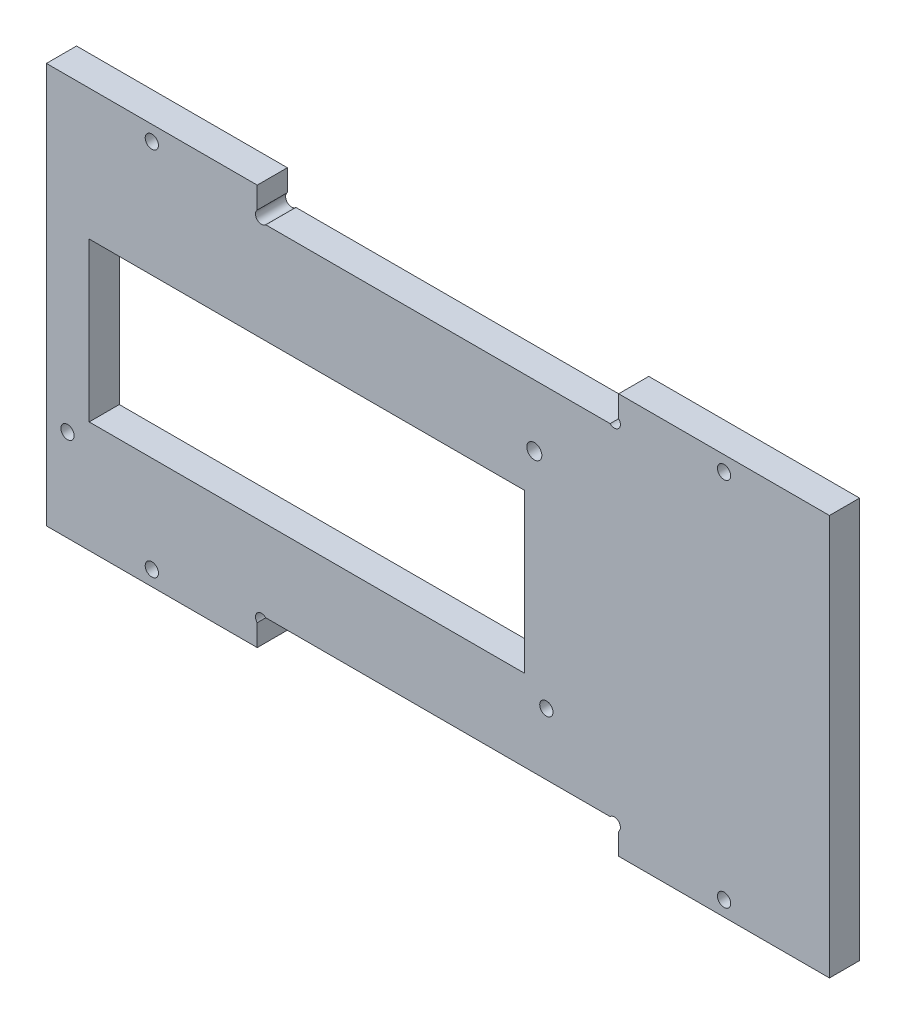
ISO-10303-21;
HEADER;
FILE_DESCRIPTION(('STEP AP214'),'2;1');
FILE_NAME('part.step','',(''),(''),'','','');
FILE_SCHEMA(('AUTOMOTIVE_DESIGN { 1 0 10303 214 1 1 1 1 }'));
ENDSEC;
DATA;
#1=APPLICATION_CONTEXT('core data for automotive mechanical design processes');
#2=APPLICATION_PROTOCOL_DEFINITION('international standard','automotive_design',2000,#1);
#3=PRODUCT_CONTEXT('',#1,'mechanical');
#4=PRODUCT('Part','Part','',(#3));
#5=PRODUCT_RELATED_PRODUCT_CATEGORY('part','',(#4));
#6=PRODUCT_DEFINITION_FORMATION('','',#4);
#7=PRODUCT_DEFINITION_CONTEXT('part definition',#1,'design');
#8=PRODUCT_DEFINITION('design','',#6,#7);
#9=PRODUCT_DEFINITION_SHAPE('','',#8);
#10=(LENGTH_UNIT() NAMED_UNIT(*) SI_UNIT(.MILLI.,.METRE.));
#11=(NAMED_UNIT(*) PLANE_ANGLE_UNIT() SI_UNIT($,.RADIAN.));
#12=(NAMED_UNIT(*) SI_UNIT($,.STERADIAN.) SOLID_ANGLE_UNIT());
#13=UNCERTAINTY_MEASURE_WITH_UNIT(LENGTH_MEASURE(1.E-05),#10,'distance_accuracy_value','');
#14=(GEOMETRIC_REPRESENTATION_CONTEXT(3) GLOBAL_UNCERTAINTY_ASSIGNED_CONTEXT((#13)) GLOBAL_UNIT_ASSIGNED_CONTEXT((#10,
#11,#12)) REPRESENTATION_CONTEXT('',''));
#15=CARTESIAN_POINT('',(0.,0.,0.));
#16=DIRECTION('',(0.,0.,1.));
#17=DIRECTION('',(1.,0.,0.));
#18=AXIS2_PLACEMENT_3D('',#15,#16,#17);
#19=CARTESIAN_POINT('',(0.,66.5,5.));
#20=DIRECTION('',(0.,0.,-1.));
#21=DIRECTION('',(-1.,0.,0.));
#22=AXIS2_PLACEMENT_3D('',#19,#20,#21);
#23=PLANE('',#22);
#24=CARTESIAN_POINT('',(112.5,2.5,5.));
#25=DIRECTION('',(0.,0.,-1.));
#26=DIRECTION('',(-1.,0.,0.));
#27=AXIS2_PLACEMENT_3D('',#24,#25,#26);
#28=CIRCLE('',#27,1.1);
#29=CARTESIAN_POINT('',(111.4,2.5,5.));
#30=VERTEX_POINT('',#29);
#31=EDGE_CURVE('E246',#30,#30,#28,.T.);
#32=ORIENTED_EDGE('',*,*,#31,.T.);
#33=EDGE_LOOP('',(#32));
#34=FACE_BOUND('',#33,.T.);
#35=CARTESIAN_POINT('',(17.5,2.5,5.));
#36=DIRECTION('',(0.,0.,1.));
#37=DIRECTION('',(1.,0.,0.));
#38=AXIS2_PLACEMENT_3D('',#35,#36,#37);
#39=CIRCLE('',#38,1.1);
#40=CARTESIAN_POINT('',(18.6,2.5,5.));
#41=VERTEX_POINT('',#40);
#42=EDGE_CURVE('E255',#41,#41,#39,.T.);
#43=ORIENTED_EDGE('',*,*,#42,.F.);
#44=EDGE_LOOP('',(#43));
#45=FACE_BOUND('',#44,.T.);
#46=DIRECTION('',(-1.,0.,0.));
#47=VECTOR('',#46,1.);
#48=CARTESIAN_POINT('',(79.4,44.8,5.));
#49=LINE('',#48,#47);
#50=CARTESIAN_POINT('',(79.4,44.8,5.));
#51=VERTEX_POINT('',#50);
#52=CARTESIAN_POINT('',(7.09999999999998,44.8,5.));
#53=VERTEX_POINT('',#52);
#54=EDGE_CURVE('E348',#51,#53,#49,.T.);
#55=ORIENTED_EDGE('',*,*,#54,.F.);
#56=DIRECTION('',(0.,1.,0.));
#57=VECTOR('',#56,1.);
#58=CARTESIAN_POINT('',(79.4,18.5,5.));
#59=LINE('',#58,#57);
#60=CARTESIAN_POINT('',(79.4,18.5,5.));
#61=VERTEX_POINT('',#60);
#62=EDGE_CURVE('E346',#61,#51,#59,.T.);
#63=ORIENTED_EDGE('',*,*,#62,.F.);
#64=DIRECTION('',(1.,0.,0.));
#65=VECTOR('',#64,1.);
#66=CARTESIAN_POINT('',(79.4,18.5,5.));
#67=LINE('',#66,#65);
#68=CARTESIAN_POINT('',(7.09999999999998,18.5,5.));
#69=VERTEX_POINT('',#68);
#70=EDGE_CURVE('E354',#69,#61,#67,.T.);
#71=ORIENTED_EDGE('',*,*,#70,.F.);
#72=DIRECTION('',(0.,-1.,0.));
#73=VECTOR('',#72,1.);
#74=CARTESIAN_POINT('',(7.09999999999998,18.5,5.));
#75=LINE('',#74,#73);
#76=EDGE_CURVE('E351',#53,#69,#75,.T.);
#77=ORIENTED_EDGE('',*,*,#76,.F.);
#78=EDGE_LOOP('',(#55,#63,#71,#77));
#79=FACE_BOUND('',#78,.T.);
#80=CARTESIAN_POINT('',(3.5,15.25,5.));
#81=DIRECTION('',(0.,0.,1.));
#82=DIRECTION('',(1.,0.,0.));
#83=AXIS2_PLACEMENT_3D('',#80,#81,#82);
#84=CIRCLE('',#83,1.1);
#85=CARTESIAN_POINT('',(4.6,15.25,5.));
#86=VERTEX_POINT('',#85);
#87=EDGE_CURVE('E370',#86,#86,#84,.T.);
#88=ORIENTED_EDGE('',*,*,#87,.F.);
#89=EDGE_LOOP('',(#88));
#90=FACE_BOUND('',#89,.T.);
#91=CARTESIAN_POINT('',(83.,15.25,5.));
#92=DIRECTION('',(0.,0.,1.));
#93=DIRECTION('',(1.,0.,0.));
#94=AXIS2_PLACEMENT_3D('',#91,#92,#93);
#95=CIRCLE('',#94,1.10000000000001);
#96=CARTESIAN_POINT('',(84.1,15.25,5.));
#97=VERTEX_POINT('',#96);
#98=EDGE_CURVE('E376',#97,#97,#95,.T.);
#99=ORIENTED_EDGE('',*,*,#98,.F.);
#100=EDGE_LOOP('',(#99));
#101=FACE_BOUND('',#100,.T.);
#102=CARTESIAN_POINT('',(81.,51.25,5.));
#103=DIRECTION('',(0.,0.,1.));
#104=DIRECTION('',(1.,0.,0.));
#105=AXIS2_PLACEMENT_3D('',#102,#103,#104);
#106=CIRCLE('',#105,1.25);
#107=CARTESIAN_POINT('',(82.25,51.25,5.));
#108=VERTEX_POINT('',#107);
#109=EDGE_CURVE('E382',#108,#108,#106,.T.);
#110=ORIENTED_EDGE('',*,*,#109,.F.);
#111=EDGE_LOOP('',(#110));
#112=FACE_BOUND('',#111,.T.);
#113=DIRECTION('',(0.,1.,0.));
#114=VECTOR('',#113,1.);
#115=CARTESIAN_POINT('',(95.,66.5,5.));
#116=LINE('',#115,#114);
#117=CARTESIAN_POINT('',(95.,62.9142135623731,5.));
#118=VERTEX_POINT('',#117);
#119=CARTESIAN_POINT('',(95.,66.5,5.));
#120=VERTEX_POINT('',#119);
#121=EDGE_CURVE('E304',#118,#120,#116,.T.);
#122=ORIENTED_EDGE('',*,*,#121,.F.);
#123=CARTESIAN_POINT('',(94.2928932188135,62.2071067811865,5.));
#124=DIRECTION('',(0.,0.,1.));
#125=DIRECTION('',(1.,0.,0.));
#126=AXIS2_PLACEMENT_3D('',#123,#124,#125);
#127=CIRCLE('',#126,0.999999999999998);
#128=CARTESIAN_POINT('',(93.5857864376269,61.5,5.));
#129=VERTEX_POINT('',#128);
#130=EDGE_CURVE('E275',#129,#118,#127,.T.);
#131=ORIENTED_EDGE('',*,*,#130,.F.);
#132=DIRECTION('',(1.,0.,0.));
#133=VECTOR('',#132,1.);
#134=CARTESIAN_POINT('',(95.,61.5,5.));
#135=LINE('',#134,#133);
#136=CARTESIAN_POINT('',(36.4142135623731,61.5,5.));
#137=VERTEX_POINT('',#136);
#138=EDGE_CURVE('E309',#137,#129,#135,.T.);
#139=ORIENTED_EDGE('',*,*,#138,.F.);
#140=CARTESIAN_POINT('',(35.7071067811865,62.2071067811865,5.));
#141=DIRECTION('',(0.,0.,1.));
#142=DIRECTION('',(1.,0.,0.));
#143=AXIS2_PLACEMENT_3D('',#140,#141,#142);
#144=CIRCLE('',#143,1.);
#145=CARTESIAN_POINT('',(35.,62.9142135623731,5.));
#146=VERTEX_POINT('',#145);
#147=EDGE_CURVE('E281',#146,#137,#144,.T.);
#148=ORIENTED_EDGE('',*,*,#147,.F.);
#149=DIRECTION('',(0.,-1.,0.));
#150=VECTOR('',#149,1.);
#151=CARTESIAN_POINT('',(35.,66.5,5.));
#152=LINE('',#151,#150);
#153=CARTESIAN_POINT('',(35.,66.5,5.));
#154=VERTEX_POINT('',#153);
#155=EDGE_CURVE('E306',#154,#146,#152,.T.);
#156=ORIENTED_EDGE('',*,*,#155,.F.);
#157=DIRECTION('',(-1.,0.,0.));
#158=VECTOR('',#157,1.);
#159=CARTESIAN_POINT('',(0.,66.5,5.));
#160=LINE('',#159,#158);
#161=CARTESIAN_POINT('',(0.,66.5,5.));
#162=VERTEX_POINT('',#161);
#163=EDGE_CURVE('E398',#154,#162,#160,.T.);
#164=ORIENTED_EDGE('',*,*,#163,.T.);
#165=DIRECTION('',(0.,-1.,0.));
#166=VECTOR('',#165,1.);
#167=CARTESIAN_POINT('',(0.,0.,5.));
#168=LINE('',#167,#166);
#169=CARTESIAN_POINT('',(0.,0.,5.));
#170=VERTEX_POINT('',#169);
#171=EDGE_CURVE('E388',#162,#170,#168,.T.);
#172=ORIENTED_EDGE('',*,*,#171,.T.);
#173=DIRECTION('',(1.,0.,0.));
#174=VECTOR('',#173,1.);
#175=CARTESIAN_POINT('',(0.,0.,5.));
#176=LINE('',#175,#174);
#177=CARTESIAN_POINT('',(35.,0.,5.));
#178=VERTEX_POINT('',#177);
#179=EDGE_CURVE('E393',#170,#178,#176,.T.);
#180=ORIENTED_EDGE('',*,*,#179,.T.);
#181=DIRECTION('',(0.,-1.,0.));
#182=VECTOR('',#181,1.);
#183=CARTESIAN_POINT('',(35.,0.,5.));
#184=LINE('',#183,#182);
#185=CARTESIAN_POINT('',(35.,3.58578643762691,5.));
#186=VERTEX_POINT('',#185);
#187=EDGE_CURVE('E327',#186,#178,#184,.T.);
#188=ORIENTED_EDGE('',*,*,#187,.F.);
#189=CARTESIAN_POINT('',(35.7071067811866,4.29289321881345,5.));
#190=DIRECTION('',(0.,0.,1.));
#191=DIRECTION('',(1.,0.,0.));
#192=AXIS2_PLACEMENT_3D('',#189,#190,#191);
#193=CIRCLE('',#192,0.999999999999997);
#194=CARTESIAN_POINT('',(36.4142135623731,4.99999999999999,5.));
#195=VERTEX_POINT('',#194);
#196=EDGE_CURVE('E287',#195,#186,#193,.T.);
#197=ORIENTED_EDGE('',*,*,#196,.F.);
#198=DIRECTION('',(-1.,0.,0.));
#199=VECTOR('',#198,1.);
#200=CARTESIAN_POINT('',(95.,5.,5.));
#201=LINE('',#200,#199);
#202=CARTESIAN_POINT('',(93.5857864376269,5.,5.));
#203=VERTEX_POINT('',#202);
#204=EDGE_CURVE('E324',#203,#195,#201,.T.);
#205=ORIENTED_EDGE('',*,*,#204,.F.);
#206=CARTESIAN_POINT('',(94.2928932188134,4.29289321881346,5.));
#207=DIRECTION('',(0.,0.,1.));
#208=DIRECTION('',(1.,0.,0.));
#209=AXIS2_PLACEMENT_3D('',#206,#207,#208);
#210=CIRCLE('',#209,0.999999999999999);
#211=CARTESIAN_POINT('',(95.,3.58578643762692,5.));
#212=VERTEX_POINT('',#211);
#213=EDGE_CURVE('E293',#212,#203,#210,.T.);
#214=ORIENTED_EDGE('',*,*,#213,.F.);
#215=DIRECTION('',(0.,1.,0.));
#216=VECTOR('',#215,1.);
#217=CARTESIAN_POINT('',(95.,0.,5.));
#218=LINE('',#217,#216);
#219=CARTESIAN_POINT('',(95.,0.,5.));
#220=VERTEX_POINT('',#219);
#221=EDGE_CURVE('E321',#220,#212,#218,.T.);
#222=ORIENTED_EDGE('',*,*,#221,.F.);
#223=CARTESIAN_POINT('',(130.,0.,5.));
#224=VERTEX_POINT('',#223);
#225=EDGE_CURVE('E391',#220,#224,#176,.T.);
#226=ORIENTED_EDGE('',*,*,#225,.T.);
#227=DIRECTION('',(0.,1.,0.));
#228=VECTOR('',#227,1.);
#229=CARTESIAN_POINT('',(130.,0.,5.));
#230=LINE('',#229,#228);
#231=CARTESIAN_POINT('',(130.,66.5,5.));
#232=VERTEX_POINT('',#231);
#233=EDGE_CURVE('E396',#224,#232,#230,.T.);
#234=ORIENTED_EDGE('',*,*,#233,.T.);
#235=EDGE_CURVE('E399',#232,#120,#160,.T.);
#236=ORIENTED_EDGE('',*,*,#235,.T.);
#237=EDGE_LOOP('',(#122,#131,#139,#148,#156,#164,#172,#180,#188,#197,#205,#214,#222,#226,#234,#236));
#238=FACE_BOUND('',#237,.T.);
#239=CARTESIAN_POINT('',(112.5,64.,5.));
#240=DIRECTION('',(0.,0.,1.));
#241=DIRECTION('',(-1.,0.,0.));
#242=AXIS2_PLACEMENT_3D('',#239,#240,#241);
#243=CIRCLE('',#242,1.1);
#244=CARTESIAN_POINT('',(111.4,64.,5.));
#245=VERTEX_POINT('',#244);
#246=EDGE_CURVE('E243',#245,#245,#243,.T.);
#247=ORIENTED_EDGE('',*,*,#246,.F.);
#248=EDGE_LOOP('',(#247));
#249=FACE_BOUND('',#248,.T.);
#250=CARTESIAN_POINT('',(17.5,64.,5.));
#251=DIRECTION('',(0.,0.,-1.));
#252=DIRECTION('',(1.,0.,0.));
#253=AXIS2_PLACEMENT_3D('',#250,#251,#252);
#254=CIRCLE('',#253,1.1);
#255=CARTESIAN_POINT('',(18.6,64.,5.));
#256=VERTEX_POINT('',#255);
#257=EDGE_CURVE('E233',#256,#256,#254,.T.);
#258=ORIENTED_EDGE('',*,*,#257,.T.);
#259=EDGE_LOOP('',(#258));
#260=FACE_BOUND('',#259,.T.);
#261=ADVANCED_FACE('F37',(#34,#45,#79,#90,#101,#112,#238,#249,#260),#23,.F.);
#262=CARTESIAN_POINT('',(0.,66.5,0.));
#263=DIRECTION('',(0.,0.,-1.));
#264=DIRECTION('',(-1.,0.,0.));
#265=AXIS2_PLACEMENT_3D('',#262,#263,#264);
#266=PLANE('',#265);
#267=DIRECTION('',(0.,-1.,0.));
#268=VECTOR('',#267,1.);
#269=CARTESIAN_POINT('',(78.4,48.3,0.));
#270=LINE('',#269,#268);
#271=CARTESIAN_POINT('',(78.4,54.8,0.));
#272=VERTEX_POINT('',#271);
#273=CARTESIAN_POINT('',(78.4,48.3,0.));
#274=VERTEX_POINT('',#273);
#275=EDGE_CURVE('E52',#272,#274,#270,.T.);
#276=ORIENTED_EDGE('',*,*,#275,.F.);
#277=DIRECTION('',(1.,0.,0.));
#278=VECTOR('',#277,1.);
#279=CARTESIAN_POINT('',(78.4,54.8,0.));
#280=LINE('',#279,#278);
#281=CARTESIAN_POINT('',(38.4,54.8,0.));
#282=VERTEX_POINT('',#281);
#283=EDGE_CURVE('E218',#282,#272,#280,.T.);
#284=ORIENTED_EDGE('',*,*,#283,.F.);
#285=DIRECTION('',(0.,1.,0.));
#286=VECTOR('',#285,1.);
#287=CARTESIAN_POINT('',(38.4,48.3,0.));
#288=LINE('',#287,#286);
#289=CARTESIAN_POINT('',(38.4,48.3,0.));
#290=VERTEX_POINT('',#289);
#291=EDGE_CURVE('E221',#290,#282,#288,.T.);
#292=ORIENTED_EDGE('',*,*,#291,.F.);
#293=DIRECTION('',(-1.,0.,0.));
#294=VECTOR('',#293,1.);
#295=CARTESIAN_POINT('',(78.4,48.3,0.));
#296=LINE('',#295,#294);
#297=EDGE_CURVE('E227',#274,#290,#296,.T.);
#298=ORIENTED_EDGE('',*,*,#297,.F.);
#299=EDGE_LOOP('',(#276,#284,#292,#298));
#300=FACE_BOUND('',#299,.T.);
#301=CARTESIAN_POINT('',(112.5,2.5,0.));
#302=DIRECTION('',(0.,0.,-1.));
#303=DIRECTION('',(-1.,0.,0.));
#304=AXIS2_PLACEMENT_3D('',#301,#302,#303);
#305=CIRCLE('',#304,1.1);
#306=CARTESIAN_POINT('',(111.4,2.5,0.));
#307=VERTEX_POINT('',#306);
#308=EDGE_CURVE('E251',#307,#307,#305,.T.);
#309=ORIENTED_EDGE('',*,*,#308,.F.);
#310=EDGE_LOOP('',(#309));
#311=FACE_BOUND('',#310,.T.);
#312=CARTESIAN_POINT('',(17.5,2.5,0.));
#313=DIRECTION('',(0.,0.,-1.));
#314=DIRECTION('',(-1.,0.,0.));
#315=AXIS2_PLACEMENT_3D('',#312,#313,#314);
#316=CIRCLE('',#315,1.1);
#317=CARTESIAN_POINT('',(16.4,2.5,0.));
#318=VERTEX_POINT('',#317);
#319=EDGE_CURVE('E254',#318,#318,#316,.F.);
#320=ORIENTED_EDGE('',*,*,#319,.T.);
#321=EDGE_LOOP('',(#320));
#322=FACE_BOUND('',#321,.T.);
#323=CARTESIAN_POINT('',(94.2928932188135,62.2071067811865,0.));
#324=DIRECTION('',(0.,0.,-1.));
#325=DIRECTION('',(-1.,0.,0.));
#326=AXIS2_PLACEMENT_3D('',#323,#324,#325);
#327=CIRCLE('',#326,0.999999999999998);
#328=CARTESIAN_POINT('',(93.5857864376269,61.5,0.));
#329=VERTEX_POINT('',#328);
#330=CARTESIAN_POINT('',(95.,62.9142135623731,0.));
#331=VERTEX_POINT('',#330);
#332=EDGE_CURVE('E277',#329,#331,#327,.F.);
#333=ORIENTED_EDGE('',*,*,#332,.T.);
#334=DIRECTION('',(0.,1.,0.));
#335=VECTOR('',#334,1.);
#336=CARTESIAN_POINT('',(95.,66.5,0.));
#337=LINE('',#336,#335);
#338=CARTESIAN_POINT('',(95.,66.5,0.));
#339=VERTEX_POINT('',#338);
#340=EDGE_CURVE('E302',#331,#339,#337,.T.);
#341=ORIENTED_EDGE('',*,*,#340,.T.);
#342=DIRECTION('',(-1.,0.,0.));
#343=VECTOR('',#342,1.);
#344=CARTESIAN_POINT('',(0.,66.5,0.));
#345=LINE('',#344,#343);
#346=CARTESIAN_POINT('',(130.,66.5,0.));
#347=VERTEX_POINT('',#346);
#348=EDGE_CURVE('E392',#347,#339,#345,.T.);
#349=ORIENTED_EDGE('',*,*,#348,.F.);
#350=DIRECTION('',(0.,1.,0.));
#351=VECTOR('',#350,1.);
#352=CARTESIAN_POINT('',(130.,0.,0.));
#353=LINE('',#352,#351);
#354=CARTESIAN_POINT('',(130.,0.,0.));
#355=VERTEX_POINT('',#354);
#356=EDGE_CURVE('E409',#355,#347,#353,.T.);
#357=ORIENTED_EDGE('',*,*,#356,.F.);
#358=DIRECTION('',(1.,0.,0.));
#359=VECTOR('',#358,1.);
#360=CARTESIAN_POINT('',(0.,0.,0.));
#361=LINE('',#360,#359);
#362=CARTESIAN_POINT('',(95.,0.,0.));
#363=VERTEX_POINT('',#362);
#364=EDGE_CURVE('E405',#363,#355,#361,.T.);
#365=ORIENTED_EDGE('',*,*,#364,.F.);
#366=DIRECTION('',(0.,1.,0.));
#367=VECTOR('',#366,1.);
#368=CARTESIAN_POINT('',(95.,0.,0.));
#369=LINE('',#368,#367);
#370=CARTESIAN_POINT('',(95.,3.58578643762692,0.));
#371=VERTEX_POINT('',#370);
#372=EDGE_CURVE('E318',#363,#371,#369,.T.);
#373=ORIENTED_EDGE('',*,*,#372,.T.);
#374=CARTESIAN_POINT('',(94.2928932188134,4.29289321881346,0.));
#375=DIRECTION('',(0.,0.,-1.));
#376=DIRECTION('',(-1.,0.,0.));
#377=AXIS2_PLACEMENT_3D('',#374,#375,#376);
#378=CIRCLE('',#377,0.999999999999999);
#379=CARTESIAN_POINT('',(93.5857864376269,5.,0.));
#380=VERTEX_POINT('',#379);
#381=EDGE_CURVE('E295',#371,#380,#378,.F.);
#382=ORIENTED_EDGE('',*,*,#381,.T.);
#383=DIRECTION('',(-1.,0.,0.));
#384=VECTOR('',#383,1.);
#385=CARTESIAN_POINT('',(95.,5.,0.));
#386=LINE('',#385,#384);
#387=CARTESIAN_POINT('',(36.4142135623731,4.99999999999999,0.));
#388=VERTEX_POINT('',#387);
#389=EDGE_CURVE('E332',#380,#388,#386,.T.);
#390=ORIENTED_EDGE('',*,*,#389,.T.);
#391=CARTESIAN_POINT('',(35.7071067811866,4.29289321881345,0.));
#392=DIRECTION('',(0.,0.,-1.));
#393=DIRECTION('',(-1.,0.,0.));
#394=AXIS2_PLACEMENT_3D('',#391,#392,#393);
#395=CIRCLE('',#394,0.999999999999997);
#396=CARTESIAN_POINT('',(35.,3.58578643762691,0.));
#397=VERTEX_POINT('',#396);
#398=EDGE_CURVE('E289',#388,#397,#395,.F.);
#399=ORIENTED_EDGE('',*,*,#398,.T.);
#400=DIRECTION('',(0.,-1.,0.));
#401=VECTOR('',#400,1.);
#402=CARTESIAN_POINT('',(35.,0.,0.));
#403=LINE('',#402,#401);
#404=CARTESIAN_POINT('',(35.,0.,0.));
#405=VERTEX_POINT('',#404);
#406=EDGE_CURVE('E314',#397,#405,#403,.T.);
#407=ORIENTED_EDGE('',*,*,#406,.T.);
#408=CARTESIAN_POINT('',(0.,0.,0.));
#409=VERTEX_POINT('',#408);
#410=EDGE_CURVE('E406',#409,#405,#361,.T.);
#411=ORIENTED_EDGE('',*,*,#410,.F.);
#412=DIRECTION('',(0.,-1.,0.));
#413=VECTOR('',#412,1.);
#414=CARTESIAN_POINT('',(0.,0.,0.));
#415=LINE('',#414,#413);
#416=CARTESIAN_POINT('',(0.,66.5,0.));
#417=VERTEX_POINT('',#416);
#418=EDGE_CURVE('E385',#417,#409,#415,.T.);
#419=ORIENTED_EDGE('',*,*,#418,.F.);
#420=CARTESIAN_POINT('',(35.,66.5,0.));
#421=VERTEX_POINT('',#420);
#422=EDGE_CURVE('E411',#421,#417,#345,.T.);
#423=ORIENTED_EDGE('',*,*,#422,.F.);
#424=DIRECTION('',(0.,-1.,0.));
#425=VECTOR('',#424,1.);
#426=CARTESIAN_POINT('',(35.,66.5,0.));
#427=LINE('',#426,#425);
#428=CARTESIAN_POINT('',(35.,62.9142135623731,0.));
#429=VERTEX_POINT('',#428);
#430=EDGE_CURVE('E298',#421,#429,#427,.T.);
#431=ORIENTED_EDGE('',*,*,#430,.T.);
#432=CARTESIAN_POINT('',(35.7071067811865,62.2071067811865,0.));
#433=DIRECTION('',(0.,0.,-1.));
#434=DIRECTION('',(-1.,0.,0.));
#435=AXIS2_PLACEMENT_3D('',#432,#433,#434);
#436=CIRCLE('',#435,1.);
#437=CARTESIAN_POINT('',(36.4142135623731,61.5,0.));
#438=VERTEX_POINT('',#437);
#439=EDGE_CURVE('E283',#429,#438,#436,.F.);
#440=ORIENTED_EDGE('',*,*,#439,.T.);
#441=DIRECTION('',(1.,0.,0.));
#442=VECTOR('',#441,1.);
#443=CARTESIAN_POINT('',(95.,61.5,0.));
#444=LINE('',#443,#442);
#445=EDGE_CURVE('E60',#438,#329,#444,.T.);
#446=ORIENTED_EDGE('',*,*,#445,.T.);
#447=EDGE_LOOP('',(#333,#341,#349,#357,#365,#373,#382,#390,#399,#407,#411,#419,#423,#431,#440,#446));
#448=FACE_BOUND('',#447,.T.);
#449=DIRECTION('',(0.,1.,0.));
#450=VECTOR('',#449,1.);
#451=CARTESIAN_POINT('',(79.4,18.5,0.));
#452=LINE('',#451,#450);
#453=CARTESIAN_POINT('',(79.4,18.5,0.));
#454=VERTEX_POINT('',#453);
#455=CARTESIAN_POINT('',(79.4,44.8,0.));
#456=VERTEX_POINT('',#455);
#457=EDGE_CURVE('E343',#454,#456,#452,.T.);
#458=ORIENTED_EDGE('',*,*,#457,.T.);
#459=DIRECTION('',(-1.,0.,0.));
#460=VECTOR('',#459,1.);
#461=CARTESIAN_POINT('',(79.4,44.8,0.));
#462=LINE('',#461,#460);
#463=CARTESIAN_POINT('',(7.09999999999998,44.8,0.));
#464=VERTEX_POINT('',#463);
#465=EDGE_CURVE('E360',#456,#464,#462,.T.);
#466=ORIENTED_EDGE('',*,*,#465,.T.);
#467=DIRECTION('',(0.,-1.,0.));
#468=VECTOR('',#467,1.);
#469=CARTESIAN_POINT('',(7.09999999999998,18.5,0.));
#470=LINE('',#469,#468);
#471=CARTESIAN_POINT('',(7.09999999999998,18.5,0.));
#472=VERTEX_POINT('',#471);
#473=EDGE_CURVE('E337',#464,#472,#470,.T.);
#474=ORIENTED_EDGE('',*,*,#473,.T.);
#475=DIRECTION('',(1.,0.,0.));
#476=VECTOR('',#475,1.);
#477=CARTESIAN_POINT('',(79.4,18.5,0.));
#478=LINE('',#477,#476);
#479=EDGE_CURVE('E340',#472,#454,#478,.T.);
#480=ORIENTED_EDGE('',*,*,#479,.T.);
#481=EDGE_LOOP('',(#458,#466,#474,#480));
#482=FACE_BOUND('',#481,.T.);
#483=CARTESIAN_POINT('',(3.5,15.25,0.));
#484=DIRECTION('',(0.,0.,-1.));
#485=DIRECTION('',(-1.,0.,0.));
#486=AXIS2_PLACEMENT_3D('',#483,#484,#485);
#487=CIRCLE('',#486,1.1);
#488=CARTESIAN_POINT('',(2.4,15.25,0.));
#489=VERTEX_POINT('',#488);
#490=EDGE_CURVE('E369',#489,#489,#487,.F.);
#491=ORIENTED_EDGE('',*,*,#490,.T.);
#492=EDGE_LOOP('',(#491));
#493=FACE_BOUND('',#492,.T.);
#494=CARTESIAN_POINT('',(83.,15.25,0.));
#495=DIRECTION('',(0.,0.,-1.));
#496=DIRECTION('',(-1.,0.,0.));
#497=AXIS2_PLACEMENT_3D('',#494,#495,#496);
#498=CIRCLE('',#497,1.10000000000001);
#499=CARTESIAN_POINT('',(81.9,15.25,0.));
#500=VERTEX_POINT('',#499);
#501=EDGE_CURVE('E373',#500,#500,#498,.F.);
#502=ORIENTED_EDGE('',*,*,#501,.T.);
#503=EDGE_LOOP('',(#502));
#504=FACE_BOUND('',#503,.T.);
#505=CARTESIAN_POINT('',(81.,51.25,0.));
#506=DIRECTION('',(0.,0.,-1.));
#507=DIRECTION('',(-1.,0.,0.));
#508=AXIS2_PLACEMENT_3D('',#505,#506,#507);
#509=CIRCLE('',#508,1.25);
#510=CARTESIAN_POINT('',(79.75,51.25,0.));
#511=VERTEX_POINT('',#510);
#512=EDGE_CURVE('E379',#511,#511,#509,.F.);
#513=ORIENTED_EDGE('',*,*,#512,.T.);
#514=EDGE_LOOP('',(#513));
#515=FACE_BOUND('',#514,.T.);
#516=CARTESIAN_POINT('',(112.5,64.,0.));
#517=DIRECTION('',(0.,0.,-1.));
#518=DIRECTION('',(-1.,0.,0.));
#519=AXIS2_PLACEMENT_3D('',#516,#517,#518);
#520=CIRCLE('',#519,1.1);
#521=CARTESIAN_POINT('',(111.4,64.,0.));
#522=VERTEX_POINT('',#521);
#523=EDGE_CURVE('E242',#522,#522,#520,.F.);
#524=ORIENTED_EDGE('',*,*,#523,.T.);
#525=EDGE_LOOP('',(#524));
#526=FACE_BOUND('',#525,.T.);
#527=CARTESIAN_POINT('',(17.5,64.,0.));
#528=DIRECTION('',(0.,0.,-1.));
#529=DIRECTION('',(-1.,0.,0.));
#530=AXIS2_PLACEMENT_3D('',#527,#528,#529);
#531=CIRCLE('',#530,1.1);
#532=CARTESIAN_POINT('',(16.4,64.,0.));
#533=VERTEX_POINT('',#532);
#534=EDGE_CURVE('E239',#533,#533,#531,.T.);
#535=ORIENTED_EDGE('',*,*,#534,.F.);
#536=EDGE_LOOP('',(#535));
#537=FACE_BOUND('',#536,.T.);
#538=ADVANCED_FACE('F429',(#300,#311,#322,#448,#482,#493,#504,#515,#526,#537),#266,.T.);
#539=CARTESIAN_POINT('',(0.,66.5,5.));
#540=DIRECTION('',(0.,-1.,0.));
#541=DIRECTION('',(0.,0.,-1.));
#542=AXIS2_PLACEMENT_3D('',#539,#540,#541);
#543=PLANE('',#542);
#544=ORIENTED_EDGE('',*,*,#348,.T.);
#545=DIRECTION('',(0.,0.,1.));
#546=VECTOR('',#545,1.);
#547=CARTESIAN_POINT('',(95.,66.5,-0.00100000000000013));
#548=LINE('',#547,#546);
#549=EDGE_CURVE('E311',#339,#120,#548,.T.);
#550=ORIENTED_EDGE('',*,*,#549,.T.);
#551=ORIENTED_EDGE('',*,*,#235,.F.);
#552=DIRECTION('',(0.,0.,-1.));
#553=VECTOR('',#552,1.);
#554=CARTESIAN_POINT('',(130.,66.5,5.));
#555=LINE('',#554,#553);
#556=EDGE_CURVE('E416',#232,#347,#555,.T.);
#557=ORIENTED_EDGE('',*,*,#556,.T.);
#558=EDGE_LOOP('',(#544,#550,#551,#557));
#559=FACE_BOUND('',#558,.T.);
#560=ADVANCED_FACE('F434',(#559),#543,.F.);
#561=CARTESIAN_POINT('',(0.,0.,5.));
#562=DIRECTION('',(0.,1.,0.));
#563=DIRECTION('',(0.,0.,1.));
#564=AXIS2_PLACEMENT_3D('',#561,#562,#563);
#565=PLANE('',#564);
#566=ORIENTED_EDGE('',*,*,#225,.F.);
#567=DIRECTION('',(0.,0.,1.));
#568=VECTOR('',#567,1.);
#569=CARTESIAN_POINT('',(95.,0.,-0.00100000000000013));
#570=LINE('',#569,#568);
#571=EDGE_CURVE('E330',#363,#220,#570,.T.);
#572=ORIENTED_EDGE('',*,*,#571,.F.);
#573=ORIENTED_EDGE('',*,*,#364,.T.);
#574=DIRECTION('',(0.,0.,-1.));
#575=VECTOR('',#574,1.);
#576=CARTESIAN_POINT('',(130.,0.,5.));
#577=LINE('',#576,#575);
#578=EDGE_CURVE('E45',#224,#355,#577,.T.);
#579=ORIENTED_EDGE('',*,*,#578,.F.);
#580=EDGE_LOOP('',(#566,#572,#573,#579));
#581=FACE_BOUND('',#580,.T.);
#582=ADVANCED_FACE('F442',(#581),#565,.F.);
#583=CARTESIAN_POINT('',(0.,0.,5.));
#584=DIRECTION('',(1.,0.,0.));
#585=DIRECTION('',(0.,0.,-1.));
#586=AXIS2_PLACEMENT_3D('',#583,#584,#585);
#587=PLANE('',#586);
#588=ORIENTED_EDGE('',*,*,#418,.T.);
#589=DIRECTION('',(0.,0.,-1.));
#590=VECTOR('',#589,1.);
#591=CARTESIAN_POINT('',(0.,0.,5.));
#592=LINE('',#591,#590);
#593=EDGE_CURVE('E11',#170,#409,#592,.T.);
#594=ORIENTED_EDGE('',*,*,#593,.F.);
#595=ORIENTED_EDGE('',*,*,#171,.F.);
#596=DIRECTION('',(0.,0.,-1.));
#597=VECTOR('',#596,1.);
#598=CARTESIAN_POINT('',(0.,66.5,5.));
#599=LINE('',#598,#597);
#600=EDGE_CURVE('E402',#162,#417,#599,.T.);
#601=ORIENTED_EDGE('',*,*,#600,.T.);
#602=EDGE_LOOP('',(#588,#594,#595,#601));
#603=FACE_BOUND('',#602,.T.);
#604=ADVANCED_FACE('F39',(#603),#587,.F.);
#605=ORIENTED_EDGE('',*,*,#410,.T.);
#606=DIRECTION('',(0.,0.,1.));
#607=VECTOR('',#606,1.);
#608=CARTESIAN_POINT('',(35.,0.,-0.00100000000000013));
#609=LINE('',#608,#607);
#610=EDGE_CURVE('E329',#405,#178,#609,.T.);
#611=ORIENTED_EDGE('',*,*,#610,.T.);
#612=ORIENTED_EDGE('',*,*,#179,.F.);
#613=ORIENTED_EDGE('',*,*,#593,.T.);
#614=EDGE_LOOP('',(#605,#611,#612,#613));
#615=FACE_BOUND('',#614,.T.);
#616=ADVANCED_FACE('F463',(#615),#565,.F.);
#617=CARTESIAN_POINT('',(130.,0.,5.));
#618=DIRECTION('',(-1.,0.,0.));
#619=DIRECTION('',(0.,0.,1.));
#620=AXIS2_PLACEMENT_3D('',#617,#618,#619);
#621=PLANE('',#620);
#622=ORIENTED_EDGE('',*,*,#356,.T.);
#623=ORIENTED_EDGE('',*,*,#556,.F.);
#624=ORIENTED_EDGE('',*,*,#233,.F.);
#625=ORIENTED_EDGE('',*,*,#578,.T.);
#626=EDGE_LOOP('',(#622,#623,#624,#625));
#627=FACE_BOUND('',#626,.T.);
#628=ADVANCED_FACE('F423',(#627),#621,.F.);
#629=ORIENTED_EDGE('',*,*,#163,.F.);
#630=DIRECTION('',(0.,0.,1.));
#631=VECTOR('',#630,1.);
#632=CARTESIAN_POINT('',(35.,66.5,-0.00100000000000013));
#633=LINE('',#632,#631);
#634=EDGE_CURVE('E312',#421,#154,#633,.T.);
#635=ORIENTED_EDGE('',*,*,#634,.F.);
#636=ORIENTED_EDGE('',*,*,#422,.T.);
#637=ORIENTED_EDGE('',*,*,#600,.F.);
#638=EDGE_LOOP('',(#629,#635,#636,#637));
#639=FACE_BOUND('',#638,.T.);
#640=ADVANCED_FACE('F472',(#639),#543,.F.);
#641=CARTESIAN_POINT('',(81.,51.25,-0.00100000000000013));
#642=DIRECTION('',(0.,0.,1.));
#643=DIRECTION('',(1.,0.,0.));
#644=AXIS2_PLACEMENT_3D('',#641,#642,#643);
#645=CYLINDRICAL_SURFACE('',#644,1.25);
#646=ORIENTED_EDGE('',*,*,#512,.F.);
#647=EDGE_LOOP('',(#646));
#648=FACE_BOUND('',#647,.T.);
#649=ORIENTED_EDGE('',*,*,#109,.T.);
#650=EDGE_LOOP('',(#649));
#651=FACE_BOUND('',#650,.T.);
#652=ADVANCED_FACE('F511',(#648,#651),#645,.F.);
#653=CARTESIAN_POINT('',(83.,15.25,-0.00100000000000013));
#654=DIRECTION('',(0.,0.,1.));
#655=DIRECTION('',(1.,0.,0.));
#656=AXIS2_PLACEMENT_3D('',#653,#654,#655);
#657=CYLINDRICAL_SURFACE('',#656,1.10000000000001);
#658=ORIENTED_EDGE('',*,*,#501,.F.);
#659=EDGE_LOOP('',(#658));
#660=FACE_BOUND('',#659,.T.);
#661=ORIENTED_EDGE('',*,*,#98,.T.);
#662=EDGE_LOOP('',(#661));
#663=FACE_BOUND('',#662,.T.);
#664=ADVANCED_FACE('F753',(#660,#663),#657,.F.);
#665=CARTESIAN_POINT('',(3.5,15.25,-0.00100000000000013));
#666=DIRECTION('',(0.,0.,1.));
#667=DIRECTION('',(1.,0.,0.));
#668=AXIS2_PLACEMENT_3D('',#665,#666,#667);
#669=CYLINDRICAL_SURFACE('',#668,1.1);
#670=ORIENTED_EDGE('',*,*,#490,.F.);
#671=EDGE_LOOP('',(#670));
#672=FACE_BOUND('',#671,.T.);
#673=ORIENTED_EDGE('',*,*,#87,.T.);
#674=EDGE_LOOP('',(#673));
#675=FACE_BOUND('',#674,.T.);
#676=ADVANCED_FACE('F744',(#672,#675),#669,.F.);
#677=CARTESIAN_POINT('',(79.4,18.5,-0.00100000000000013));
#678=DIRECTION('',(1.,0.,0.));
#679=DIRECTION('',(0.,0.,-1.));
#680=AXIS2_PLACEMENT_3D('',#677,#678,#679);
#681=PLANE('',#680);
#682=DIRECTION('',(0.,0.,1.));
#683=VECTOR('',#682,1.);
#684=CARTESIAN_POINT('',(79.4,18.5,-0.00100000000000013));
#685=LINE('',#684,#683);
#686=EDGE_CURVE('E358',#454,#61,#685,.T.);
#687=ORIENTED_EDGE('',*,*,#686,.T.);
#688=ORIENTED_EDGE('',*,*,#62,.T.);
#689=DIRECTION('',(0.,0.,1.));
#690=VECTOR('',#689,1.);
#691=CARTESIAN_POINT('',(79.4,44.8,-0.00100000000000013));
#692=LINE('',#691,#690);
#693=EDGE_CURVE('E357',#456,#51,#692,.T.);
#694=ORIENTED_EDGE('',*,*,#693,.F.);
#695=ORIENTED_EDGE('',*,*,#457,.F.);
#696=EDGE_LOOP('',(#687,#688,#694,#695));
#697=FACE_BOUND('',#696,.T.);
#698=ADVANCED_FACE('F735',(#697),#681,.F.);
#699=CARTESIAN_POINT('',(79.4,18.5,-0.00100000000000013));
#700=DIRECTION('',(0.,-1.,0.));
#701=DIRECTION('',(1.,0.,0.));
#702=AXIS2_PLACEMENT_3D('',#699,#700,#701);
#703=PLANE('',#702);
#704=DIRECTION('',(0.,0.,1.));
#705=VECTOR('',#704,1.);
#706=CARTESIAN_POINT('',(7.09999999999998,18.5,-0.00100000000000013));
#707=LINE('',#706,#705);
#708=EDGE_CURVE('E361',#472,#69,#707,.T.);
#709=ORIENTED_EDGE('',*,*,#708,.T.);
#710=ORIENTED_EDGE('',*,*,#70,.T.);
#711=ORIENTED_EDGE('',*,*,#686,.F.);
#712=ORIENTED_EDGE('',*,*,#479,.F.);
#713=EDGE_LOOP('',(#709,#710,#711,#712));
#714=FACE_BOUND('',#713,.T.);
#715=ADVANCED_FACE('F726',(#714),#703,.F.);
#716=CARTESIAN_POINT('',(7.09999999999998,18.5,-0.00100000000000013));
#717=DIRECTION('',(-1.,0.,0.));
#718=DIRECTION('',(0.,-1.,0.));
#719=AXIS2_PLACEMENT_3D('',#716,#717,#718);
#720=PLANE('',#719);
#721=DIRECTION('',(0.,0.,1.));
#722=VECTOR('',#721,1.);
#723=CARTESIAN_POINT('',(7.09999999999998,44.8,-0.00100000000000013));
#724=LINE('',#723,#722);
#725=EDGE_CURVE('E363',#464,#53,#724,.T.);
#726=ORIENTED_EDGE('',*,*,#725,.T.);
#727=ORIENTED_EDGE('',*,*,#76,.T.);
#728=ORIENTED_EDGE('',*,*,#708,.F.);
#729=ORIENTED_EDGE('',*,*,#473,.F.);
#730=EDGE_LOOP('',(#726,#727,#728,#729));
#731=FACE_BOUND('',#730,.T.);
#732=ADVANCED_FACE('F717',(#731),#720,.F.);
#733=CARTESIAN_POINT('',(79.4,44.8,-0.00100000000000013));
#734=DIRECTION('',(0.,1.,0.));
#735=DIRECTION('',(-1.,0.,0.));
#736=AXIS2_PLACEMENT_3D('',#733,#734,#735);
#737=PLANE('',#736);
#738=ORIENTED_EDGE('',*,*,#693,.T.);
#739=ORIENTED_EDGE('',*,*,#54,.T.);
#740=ORIENTED_EDGE('',*,*,#725,.F.);
#741=ORIENTED_EDGE('',*,*,#465,.F.);
#742=EDGE_LOOP('',(#738,#739,#740,#741));
#743=FACE_BOUND('',#742,.T.);
#744=ADVANCED_FACE('F702',(#743),#737,.F.);
#745=CARTESIAN_POINT('',(95.,0.,-0.00100000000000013));
#746=DIRECTION('',(1.,0.,0.));
#747=DIRECTION('',(0.,0.,-1.));
#748=AXIS2_PLACEMENT_3D('',#745,#746,#747);
#749=PLANE('',#748);
#750=ORIENTED_EDGE('',*,*,#221,.T.);
#751=DIRECTION('',(0.,0.,1.));
#752=VECTOR('',#751,1.);
#753=CARTESIAN_POINT('',(95.,3.58578643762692,-0.00100000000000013));
#754=LINE('',#753,#752);
#755=EDGE_CURVE('E269',#371,#212,#754,.T.);
#756=ORIENTED_EDGE('',*,*,#755,.F.);
#757=ORIENTED_EDGE('',*,*,#372,.F.);
#758=ORIENTED_EDGE('',*,*,#571,.T.);
#759=EDGE_LOOP('',(#750,#756,#757,#758));
#760=FACE_BOUND('',#759,.T.);
#761=ADVANCED_FACE('F444',(#760),#749,.F.);
#762=CARTESIAN_POINT('',(35.,0.,-0.00100000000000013));
#763=DIRECTION('',(-1.,0.,0.));
#764=DIRECTION('',(0.,0.,1.));
#765=AXIS2_PLACEMENT_3D('',#762,#763,#764);
#766=PLANE('',#765);
#767=ORIENTED_EDGE('',*,*,#406,.F.);
#768=DIRECTION('',(0.,0.,1.));
#769=VECTOR('',#768,1.);
#770=CARTESIAN_POINT('',(35.,3.58578643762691,-0.00100000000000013));
#771=LINE('',#770,#769);
#772=EDGE_CURVE('E266',#186,#397,#771,.F.);
#773=ORIENTED_EDGE('',*,*,#772,.F.);
#774=ORIENTED_EDGE('',*,*,#187,.T.);
#775=ORIENTED_EDGE('',*,*,#610,.F.);
#776=EDGE_LOOP('',(#767,#773,#774,#775));
#777=FACE_BOUND('',#776,.T.);
#778=ADVANCED_FACE('F461',(#777),#766,.F.);
#779=CARTESIAN_POINT('',(95.,5.,-0.00100000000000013));
#780=DIRECTION('',(0.,1.,0.));
#781=DIRECTION('',(-1.,0.,0.));
#782=AXIS2_PLACEMENT_3D('',#779,#780,#781);
#783=PLANE('',#782);
#784=ORIENTED_EDGE('',*,*,#204,.T.);
#785=DIRECTION('',(0.,0.,1.));
#786=VECTOR('',#785,1.);
#787=CARTESIAN_POINT('',(36.4142135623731,4.99999999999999,-0.00100000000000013));
#788=LINE('',#787,#786);
#789=EDGE_CURVE('E285',#388,#195,#788,.T.);
#790=ORIENTED_EDGE('',*,*,#789,.F.);
#791=ORIENTED_EDGE('',*,*,#389,.F.);
#792=DIRECTION('',(0.,0.,1.));
#793=VECTOR('',#792,1.);
#794=CARTESIAN_POINT('',(93.5857864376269,5.,-0.00100000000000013));
#795=LINE('',#794,#793);
#796=EDGE_CURVE('E291',#203,#380,#795,.F.);
#797=ORIENTED_EDGE('',*,*,#796,.F.);
#798=EDGE_LOOP('',(#784,#790,#791,#797));
#799=FACE_BOUND('',#798,.T.);
#800=ADVANCED_FACE('F451',(#799),#783,.F.);
#801=CARTESIAN_POINT('',(95.,66.5,-0.00100000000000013));
#802=DIRECTION('',(1.,0.,0.));
#803=DIRECTION('',(0.,0.,-1.));
#804=AXIS2_PLACEMENT_3D('',#801,#802,#803);
#805=PLANE('',#804);
#806=ORIENTED_EDGE('',*,*,#340,.F.);
#807=DIRECTION('',(0.,0.,1.));
#808=VECTOR('',#807,1.);
#809=CARTESIAN_POINT('',(95.,62.9142135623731,-0.00100000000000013));
#810=LINE('',#809,#808);
#811=EDGE_CURVE('E258',#118,#331,#810,.F.);
#812=ORIENTED_EDGE('',*,*,#811,.F.);
#813=ORIENTED_EDGE('',*,*,#121,.T.);
#814=ORIENTED_EDGE('',*,*,#549,.F.);
#815=EDGE_LOOP('',(#806,#812,#813,#814));
#816=FACE_BOUND('',#815,.T.);
#817=ADVANCED_FACE('F490',(#816),#805,.F.);
#818=CARTESIAN_POINT('',(95.,61.5,-0.00100000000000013));
#819=DIRECTION('',(0.,-1.,0.));
#820=DIRECTION('',(1.,0.,0.));
#821=AXIS2_PLACEMENT_3D('',#818,#819,#820);
#822=PLANE('',#821);
#823=ORIENTED_EDGE('',*,*,#445,.F.);
#824=DIRECTION('',(0.,0.,1.));
#825=VECTOR('',#824,1.);
#826=CARTESIAN_POINT('',(36.4142135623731,61.5,-0.00100000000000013));
#827=LINE('',#826,#825);
#828=EDGE_CURVE('E263',#137,#438,#827,.F.);
#829=ORIENTED_EDGE('',*,*,#828,.F.);
#830=ORIENTED_EDGE('',*,*,#138,.T.);
#831=DIRECTION('',(0.,0.,1.));
#832=VECTOR('',#831,1.);
#833=CARTESIAN_POINT('',(93.5857864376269,61.5,-0.00100000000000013));
#834=LINE('',#833,#832);
#835=EDGE_CURVE('E272',#329,#129,#834,.T.);
#836=ORIENTED_EDGE('',*,*,#835,.F.);
#837=EDGE_LOOP('',(#823,#829,#830,#836));
#838=FACE_BOUND('',#837,.T.);
#839=ADVANCED_FACE('F484',(#838),#822,.F.);
#840=CARTESIAN_POINT('',(35.,66.5,-0.00100000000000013));
#841=DIRECTION('',(-1.,0.,0.));
#842=DIRECTION('',(0.,0.,1.));
#843=AXIS2_PLACEMENT_3D('',#840,#841,#842);
#844=PLANE('',#843);
#845=ORIENTED_EDGE('',*,*,#155,.T.);
#846=DIRECTION('',(0.,0.,1.));
#847=VECTOR('',#846,1.);
#848=CARTESIAN_POINT('',(35.,62.9142135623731,-0.00100000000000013));
#849=LINE('',#848,#847);
#850=EDGE_CURVE('E279',#429,#146,#849,.T.);
#851=ORIENTED_EDGE('',*,*,#850,.F.);
#852=ORIENTED_EDGE('',*,*,#430,.F.);
#853=ORIENTED_EDGE('',*,*,#634,.T.);
#854=EDGE_LOOP('',(#845,#851,#852,#853));
#855=FACE_BOUND('',#854,.T.);
#856=ADVANCED_FACE('F476',(#855),#844,.F.);
#857=CARTESIAN_POINT('',(94.2928932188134,4.29289321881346,-0.00100000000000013));
#858=DIRECTION('',(0.,0.,1.));
#859=DIRECTION('',(1.,0.,0.));
#860=AXIS2_PLACEMENT_3D('',#857,#858,#859);
#861=CYLINDRICAL_SURFACE('',#860,0.999999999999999);
#862=ORIENTED_EDGE('',*,*,#796,.T.);
#863=ORIENTED_EDGE('',*,*,#381,.F.);
#864=ORIENTED_EDGE('',*,*,#755,.T.);
#865=ORIENTED_EDGE('',*,*,#213,.T.);
#866=EDGE_LOOP('',(#862,#863,#864,#865));
#867=FACE_BOUND('',#866,.T.);
#868=ADVANCED_FACE('F609',(#867),#861,.F.);
#869=CARTESIAN_POINT('',(35.7071067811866,4.29289321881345,-0.00100000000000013));
#870=DIRECTION('',(0.,0.,1.));
#871=DIRECTION('',(1.,0.,0.));
#872=AXIS2_PLACEMENT_3D('',#869,#870,#871);
#873=CYLINDRICAL_SURFACE('',#872,0.999999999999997);
#874=ORIENTED_EDGE('',*,*,#196,.T.);
#875=ORIENTED_EDGE('',*,*,#772,.T.);
#876=ORIENTED_EDGE('',*,*,#398,.F.);
#877=ORIENTED_EDGE('',*,*,#789,.T.);
#878=EDGE_LOOP('',(#874,#875,#876,#877));
#879=FACE_BOUND('',#878,.T.);
#880=ADVANCED_FACE('F455',(#879),#873,.F.);
#881=CARTESIAN_POINT('',(35.7071067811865,62.2071067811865,-0.00100000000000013));
#882=DIRECTION('',(0.,0.,1.));
#883=DIRECTION('',(1.,0.,0.));
#884=AXIS2_PLACEMENT_3D('',#881,#882,#883);
#885=CYLINDRICAL_SURFACE('',#884,1.);
#886=ORIENTED_EDGE('',*,*,#147,.T.);
#887=ORIENTED_EDGE('',*,*,#828,.T.);
#888=ORIENTED_EDGE('',*,*,#439,.F.);
#889=ORIENTED_EDGE('',*,*,#850,.T.);
#890=EDGE_LOOP('',(#886,#887,#888,#889));
#891=FACE_BOUND('',#890,.T.);
#892=ADVANCED_FACE('F482',(#891),#885,.F.);
#893=CARTESIAN_POINT('',(94.2928932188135,62.2071067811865,-0.00100000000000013));
#894=DIRECTION('',(0.,0.,1.));
#895=DIRECTION('',(1.,0.,0.));
#896=AXIS2_PLACEMENT_3D('',#893,#894,#895);
#897=CYLINDRICAL_SURFACE('',#896,0.999999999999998);
#898=ORIENTED_EDGE('',*,*,#130,.T.);
#899=ORIENTED_EDGE('',*,*,#811,.T.);
#900=ORIENTED_EDGE('',*,*,#332,.F.);
#901=ORIENTED_EDGE('',*,*,#835,.T.);
#902=EDGE_LOOP('',(#898,#899,#900,#901));
#903=FACE_BOUND('',#902,.T.);
#904=ADVANCED_FACE('F487',(#903),#897,.F.);
#905=CARTESIAN_POINT('',(17.5,2.5,-0.00100000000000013));
#906=DIRECTION('',(0.,0.,1.));
#907=DIRECTION('',(1.,0.,0.));
#908=AXIS2_PLACEMENT_3D('',#905,#906,#907);
#909=CYLINDRICAL_SURFACE('',#908,1.1);
#910=ORIENTED_EDGE('',*,*,#319,.F.);
#911=EDGE_LOOP('',(#910));
#912=FACE_BOUND('',#911,.T.);
#913=ORIENTED_EDGE('',*,*,#42,.T.);
#914=EDGE_LOOP('',(#913));
#915=FACE_BOUND('',#914,.T.);
#916=ADVANCED_FACE('F598',(#912,#915),#909,.F.);
#917=CARTESIAN_POINT('',(112.5,2.5,-0.00100000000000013));
#918=DIRECTION('',(0.,0.,1.));
#919=DIRECTION('',(1.,0.,0.));
#920=AXIS2_PLACEMENT_3D('',#917,#918,#919);
#921=CYLINDRICAL_SURFACE('',#920,1.1);
#922=ORIENTED_EDGE('',*,*,#308,.T.);
#923=EDGE_LOOP('',(#922));
#924=FACE_BOUND('',#923,.T.);
#925=ORIENTED_EDGE('',*,*,#31,.F.);
#926=EDGE_LOOP('',(#925));
#927=FACE_BOUND('',#926,.T.);
#928=ADVANCED_FACE('F594',(#924,#927),#921,.F.);
#929=CARTESIAN_POINT('',(112.5,64.,-0.00100000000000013));
#930=DIRECTION('',(0.,0.,1.));
#931=DIRECTION('',(1.,0.,0.));
#932=AXIS2_PLACEMENT_3D('',#929,#930,#931);
#933=CYLINDRICAL_SURFACE('',#932,1.1);
#934=ORIENTED_EDGE('',*,*,#523,.F.);
#935=EDGE_LOOP('',(#934));
#936=FACE_BOUND('',#935,.T.);
#937=ORIENTED_EDGE('',*,*,#246,.T.);
#938=EDGE_LOOP('',(#937));
#939=FACE_BOUND('',#938,.T.);
#940=ADVANCED_FACE('F590',(#936,#939),#933,.F.);
#941=CARTESIAN_POINT('',(17.5,64.,-0.00100000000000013));
#942=DIRECTION('',(0.,0.,1.));
#943=DIRECTION('',(1.,0.,0.));
#944=AXIS2_PLACEMENT_3D('',#941,#942,#943);
#945=CYLINDRICAL_SURFACE('',#944,1.1);
#946=ORIENTED_EDGE('',*,*,#534,.T.);
#947=EDGE_LOOP('',(#946));
#948=FACE_BOUND('',#947,.T.);
#949=ORIENTED_EDGE('',*,*,#257,.F.);
#950=EDGE_LOOP('',(#949));
#951=FACE_BOUND('',#950,.T.);
#952=ADVANCED_FACE('F540',(#948,#951),#945,.F.);
#953=CARTESIAN_POINT('',(78.4,48.3,1.));
#954=DIRECTION('',(1.,0.,0.));
#955=DIRECTION('',(0.,0.,-1.));
#956=AXIS2_PLACEMENT_3D('',#953,#954,#955);
#957=PLANE('',#956);
#958=ORIENTED_EDGE('',*,*,#275,.T.);
#959=DIRECTION('',(0.,0.,-1.));
#960=VECTOR('',#959,1.);
#961=CARTESIAN_POINT('',(78.4,48.3,1.));
#962=LINE('',#961,#960);
#963=CARTESIAN_POINT('',(78.4,48.3,1.));
#964=VERTEX_POINT('',#963);
#965=EDGE_CURVE('E196',#964,#274,#962,.T.);
#966=ORIENTED_EDGE('',*,*,#965,.F.);
#967=DIRECTION('',(0.,-1.,0.));
#968=VECTOR('',#967,1.);
#969=CARTESIAN_POINT('',(78.4,48.3,1.));
#970=LINE('',#969,#968);
#971=CARTESIAN_POINT('',(78.4,54.8,1.));
#972=VERTEX_POINT('',#971);
#973=EDGE_CURVE('E200',#972,#964,#970,.T.);
#974=ORIENTED_EDGE('',*,*,#973,.F.);
#975=DIRECTION('',(0.,0.,-1.));
#976=VECTOR('',#975,1.);
#977=CARTESIAN_POINT('',(78.4,54.8,1.));
#978=LINE('',#977,#976);
#979=EDGE_CURVE('E231',#972,#272,#978,.T.);
#980=ORIENTED_EDGE('',*,*,#979,.T.);
#981=EDGE_LOOP('',(#958,#966,#974,#980));
#982=FACE_BOUND('',#981,.T.);
#983=ADVANCED_FACE('F198',(#982),#957,.F.);
#984=CARTESIAN_POINT('',(78.4,54.8,1.));
#985=DIRECTION('',(0.,1.,0.));
#986=DIRECTION('',(0.,0.,1.));
#987=AXIS2_PLACEMENT_3D('',#984,#985,#986);
#988=PLANE('',#987);
#989=ORIENTED_EDGE('',*,*,#283,.T.);
#990=ORIENTED_EDGE('',*,*,#979,.F.);
#991=DIRECTION('',(1.,0.,0.));
#992=VECTOR('',#991,1.);
#993=CARTESIAN_POINT('',(78.4,54.8,1.));
#994=LINE('',#993,#992);
#995=CARTESIAN_POINT('',(38.4,54.8,1.));
#996=VERTEX_POINT('',#995);
#997=EDGE_CURVE('E206',#996,#972,#994,.T.);
#998=ORIENTED_EDGE('',*,*,#997,.F.);
#999=DIRECTION('',(0.,0.,-1.));
#1000=VECTOR('',#999,1.);
#1001=CARTESIAN_POINT('',(38.4,54.8,1.));
#1002=LINE('',#1001,#1000);
#1003=EDGE_CURVE('E234',#996,#282,#1002,.T.);
#1004=ORIENTED_EDGE('',*,*,#1003,.T.);
#1005=EDGE_LOOP('',(#989,#990,#998,#1004));
#1006=FACE_BOUND('',#1005,.T.);
#1007=ADVANCED_FACE('F549',(#1006),#988,.F.);
#1008=CARTESIAN_POINT('',(38.4,48.3,1.));
#1009=DIRECTION('',(-1.,0.,0.));
#1010=DIRECTION('',(0.,0.,1.));
#1011=AXIS2_PLACEMENT_3D('',#1008,#1009,#1010);
#1012=PLANE('',#1011);
#1013=ORIENTED_EDGE('',*,*,#291,.T.);
#1014=ORIENTED_EDGE('',*,*,#1003,.F.);
#1015=DIRECTION('',(0.,1.,0.));
#1016=VECTOR('',#1015,1.);
#1017=CARTESIAN_POINT('',(38.4,48.3,1.));
#1018=LINE('',#1017,#1016);
#1019=CARTESIAN_POINT('',(38.4,48.3,1.));
#1020=VERTEX_POINT('',#1019);
#1021=EDGE_CURVE('E214',#1020,#996,#1018,.T.);
#1022=ORIENTED_EDGE('',*,*,#1021,.F.);
#1023=DIRECTION('',(0.,0.,-1.));
#1024=VECTOR('',#1023,1.);
#1025=CARTESIAN_POINT('',(38.4,48.3,1.));
#1026=LINE('',#1025,#1024);
#1027=EDGE_CURVE('E205',#1020,#290,#1026,.T.);
#1028=ORIENTED_EDGE('',*,*,#1027,.T.);
#1029=EDGE_LOOP('',(#1013,#1014,#1022,#1028));
#1030=FACE_BOUND('',#1029,.T.);
#1031=ADVANCED_FACE('F558',(#1030),#1012,.F.);
#1032=CARTESIAN_POINT('',(78.4,48.3,1.));
#1033=DIRECTION('',(0.,-1.,0.));
#1034=DIRECTION('',(0.,0.,-1.));
#1035=AXIS2_PLACEMENT_3D('',#1032,#1033,#1034);
#1036=PLANE('',#1035);
#1037=ORIENTED_EDGE('',*,*,#297,.T.);
#1038=ORIENTED_EDGE('',*,*,#1027,.F.);
#1039=DIRECTION('',(-1.,0.,0.));
#1040=VECTOR('',#1039,1.);
#1041=CARTESIAN_POINT('',(78.4,48.3,1.));
#1042=LINE('',#1041,#1040);
#1043=EDGE_CURVE('E209',#964,#1020,#1042,.T.);
#1044=ORIENTED_EDGE('',*,*,#1043,.F.);
#1045=ORIENTED_EDGE('',*,*,#965,.T.);
#1046=EDGE_LOOP('',(#1037,#1038,#1044,#1045));
#1047=FACE_BOUND('',#1046,.T.);
#1048=ADVANCED_FACE('F210',(#1047),#1036,.F.);
#1049=CARTESIAN_POINT('',(78.4,54.8,1.));
#1050=DIRECTION('',(0.,0.,1.));
#1051=DIRECTION('',(1.,0.,0.));
#1052=AXIS2_PLACEMENT_3D('',#1049,#1050,#1051);
#1053=PLANE('',#1052);
#1054=ORIENTED_EDGE('',*,*,#973,.T.);
#1055=ORIENTED_EDGE('',*,*,#1043,.T.);
#1056=ORIENTED_EDGE('',*,*,#1021,.T.);
#1057=ORIENTED_EDGE('',*,*,#997,.T.);
#1058=EDGE_LOOP('',(#1054,#1055,#1056,#1057));
#1059=FACE_BOUND('',#1058,.T.);
#1060=ADVANCED_FACE('F216',(#1059),#1053,.F.);
#1061=CLOSED_SHELL('',(#261,#538,#560,#582,#604,#616,#628,#640,#652,#664,#676,#698,#715,#732,
#744,#761,#778,#800,#817,#839,#856,#868,#880,#892,#904,#916,#928,#940,#952,#983,#1007,#1031,
#1048,#1060));
#1062=MANIFOLD_SOLID_BREP('B2',#1061);
#1063=ADVANCED_BREP_SHAPE_REPRESENTATION('',(#18,#1062),#14);
#1064=SHAPE_DEFINITION_REPRESENTATION(#9,#1063);
ENDSEC;
END-ISO-10303-21;
